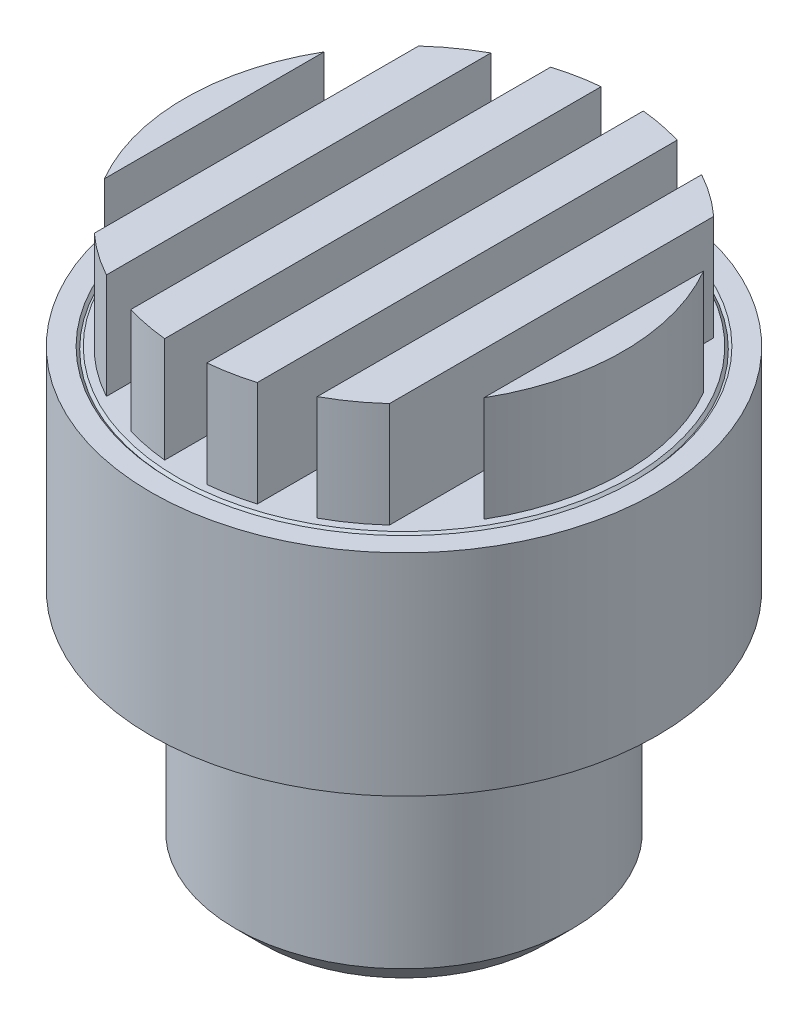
ISO-10303-21;
HEADER;
FILE_DESCRIPTION(('STEP AP214'),'2;1');
FILE_NAME('part.step','',(''),(''),'','','');
FILE_SCHEMA(('AUTOMOTIVE_DESIGN { 1 0 10303 214 1 1 1 1 }'));
ENDSEC;
DATA;
#1=APPLICATION_CONTEXT('core data for automotive mechanical design processes');
#2=APPLICATION_PROTOCOL_DEFINITION('international standard','automotive_design',2000,#1);
#3=PRODUCT_CONTEXT('',#1,'mechanical');
#4=PRODUCT('Part','Part','',(#3));
#5=PRODUCT_RELATED_PRODUCT_CATEGORY('part','',(#4));
#6=PRODUCT_DEFINITION_FORMATION('','',#4);
#7=PRODUCT_DEFINITION_CONTEXT('part definition',#1,'design');
#8=PRODUCT_DEFINITION('design','',#6,#7);
#9=PRODUCT_DEFINITION_SHAPE('','',#8);
#10=(LENGTH_UNIT() NAMED_UNIT(*) SI_UNIT(.MILLI.,.METRE.));
#11=(NAMED_UNIT(*) PLANE_ANGLE_UNIT() SI_UNIT($,.RADIAN.));
#12=(NAMED_UNIT(*) SI_UNIT($,.STERADIAN.) SOLID_ANGLE_UNIT());
#13=UNCERTAINTY_MEASURE_WITH_UNIT(LENGTH_MEASURE(1.E-05),#10,'distance_accuracy_value','');
#14=(GEOMETRIC_REPRESENTATION_CONTEXT(3) GLOBAL_UNCERTAINTY_ASSIGNED_CONTEXT((#13)) GLOBAL_UNIT_ASSIGNED_CONTEXT((#10,
#11,#12)) REPRESENTATION_CONTEXT('',''));
#15=CARTESIAN_POINT('',(0.,0.,0.));
#16=DIRECTION('',(0.,0.,1.));
#17=DIRECTION('',(1.,0.,0.));
#18=AXIS2_PLACEMENT_3D('',#15,#16,#17);
#19=CARTESIAN_POINT('',(7.07690790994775,20.0289948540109,5.52291893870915));
#20=DIRECTION('',(0.,1.,0.));
#21=DIRECTION('',(0.,0.,1.));
#22=AXIS2_PLACEMENT_3D('',#19,#20,#21);
#23=PLANE('',#22);
#24=CARTESIAN_POINT('',(7.07690790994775,20.0289948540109,5.52291893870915));
#25=DIRECTION('',(0.,1.,0.));
#26=DIRECTION('',(0.,0.,1.));
#27=AXIS2_PLACEMENT_3D('',#24,#25,#26);
#28=CIRCLE('',#27,19.05);
#29=CARTESIAN_POINT('',(7.07690790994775,20.0289948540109,24.5729189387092));
#30=VERTEX_POINT('',#29);
#31=EDGE_CURVE('E435',#30,#30,#28,.T.);
#32=ORIENTED_EDGE('',*,*,#31,.T.);
#33=EDGE_LOOP('',(#32));
#34=FACE_BOUND('',#33,.T.);
#35=CARTESIAN_POINT('',(7.07690790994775,20.0289948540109,5.52291893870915));
#36=DIRECTION('',(0.,1.,0.));
#37=DIRECTION('',(0.,0.,1.));
#38=AXIS2_PLACEMENT_3D('',#35,#36,#37);
#39=CIRCLE('',#38,17.4625);
#40=CARTESIAN_POINT('',(7.07690790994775,20.0289948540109,22.9854189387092));
#41=VERTEX_POINT('',#40);
#42=EDGE_CURVE('E276',#41,#41,#39,.F.);
#43=ORIENTED_EDGE('',*,*,#42,.T.);
#44=EDGE_LOOP('',(#43));
#45=FACE_BOUND('',#44,.T.);
#46=ADVANCED_FACE('F17',(#34,#45),#23,.T.);
#47=CARTESIAN_POINT('',(7.07690790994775,4.15399485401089,5.52291893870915));
#48=DIRECTION('',(0.,-1.,0.));
#49=DIRECTION('',(0.,0.,-1.));
#50=AXIS2_PLACEMENT_3D('',#47,#48,#49);
#51=CYLINDRICAL_SURFACE('',#50,12.7);
#52=CARTESIAN_POINT('',(7.07690790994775,-11.5940051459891,5.52291893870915));
#53=DIRECTION('',(0.,1.,0.));
#54=DIRECTION('',(0.,0.,1.));
#55=AXIS2_PLACEMENT_3D('',#52,#53,#54);
#56=CIRCLE('',#55,12.7);
#57=CARTESIAN_POINT('',(7.07690790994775,-11.5940051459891,18.2229189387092));
#58=VERTEX_POINT('',#57);
#59=EDGE_CURVE('E26',#58,#58,#56,.T.);
#60=ORIENTED_EDGE('',*,*,#59,.T.);
#61=EDGE_LOOP('',(#60));
#62=FACE_BOUND('',#61,.T.);
#63=CARTESIAN_POINT('',(7.07690790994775,4.15399485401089,5.52291893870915));
#64=DIRECTION('',(0.,1.,0.));
#65=DIRECTION('',(0.,0.,1.));
#66=AXIS2_PLACEMENT_3D('',#63,#64,#65);
#67=CIRCLE('',#66,12.7);
#68=CARTESIAN_POINT('',(7.07690790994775,4.15399485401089,18.2229189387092));
#69=VERTEX_POINT('',#68);
#70=EDGE_CURVE('E438',#69,#69,#67,.T.);
#71=ORIENTED_EDGE('',*,*,#70,.F.);
#72=EDGE_LOOP('',(#71));
#73=FACE_BOUND('',#72,.T.);
#74=ADVANCED_FACE('F224',(#62,#73),#51,.T.);
#75=CARTESIAN_POINT('',(7.07690790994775,-13.6260051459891,5.52291893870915));
#76=DIRECTION('',(0.,1.,0.));
#77=DIRECTION('',(0.,0.,1.));
#78=AXIS2_PLACEMENT_3D('',#75,#76,#77);
#79=PLANE('',#78);
#80=CARTESIAN_POINT('',(7.07690790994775,-13.6260051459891,5.52291893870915));
#81=DIRECTION('',(0.,-1.,0.));
#82=DIRECTION('',(0.,0.,-1.));
#83=AXIS2_PLACEMENT_3D('',#80,#81,#82);
#84=CIRCLE('',#83,9.398);
#85=CARTESIAN_POINT('',(7.07690790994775,-13.6260051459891,-3.87508106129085));
#86=VERTEX_POINT('',#85);
#87=EDGE_CURVE('E478',#86,#86,#84,.T.);
#88=ORIENTED_EDGE('',*,*,#87,.F.);
#89=EDGE_LOOP('',(#88));
#90=FACE_BOUND('',#89,.T.);
#91=CARTESIAN_POINT('',(7.07690790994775,-13.6260051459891,5.52291893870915));
#92=DIRECTION('',(0.,1.,0.));
#93=DIRECTION('',(0.,0.,1.));
#94=AXIS2_PLACEMENT_3D('',#91,#92,#93);
#95=CIRCLE('',#94,10.668);
#96=CARTESIAN_POINT('',(7.07690790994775,-13.6260051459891,16.1909189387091));
#97=VERTEX_POINT('',#96);
#98=EDGE_CURVE('E11',#97,#97,#95,.F.);
#99=ORIENTED_EDGE('',*,*,#98,.T.);
#100=EDGE_LOOP('',(#99));
#101=FACE_BOUND('',#100,.T.);
#102=ADVANCED_FACE('F231',(#90,#101),#79,.F.);
#103=CARTESIAN_POINT('',(7.07690790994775,20.0289948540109,5.52291893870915));
#104=DIRECTION('',(0.,-1.,0.));
#105=DIRECTION('',(0.,0.,-1.));
#106=AXIS2_PLACEMENT_3D('',#103,#104,#105);
#107=CYLINDRICAL_SURFACE('',#106,19.05);
#108=ORIENTED_EDGE('',*,*,#31,.F.);
#109=EDGE_LOOP('',(#108));
#110=FACE_BOUND('',#109,.T.);
#111=CARTESIAN_POINT('',(7.07690790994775,4.15399485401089,5.52291893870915));
#112=DIRECTION('',(0.,1.,0.));
#113=DIRECTION('',(0.,0.,1.));
#114=AXIS2_PLACEMENT_3D('',#111,#112,#113);
#115=CIRCLE('',#114,19.05);
#116=CARTESIAN_POINT('',(7.07690790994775,4.15399485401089,24.5729189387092));
#117=VERTEX_POINT('',#116);
#118=EDGE_CURVE('E439',#117,#117,#115,.T.);
#119=ORIENTED_EDGE('',*,*,#118,.T.);
#120=EDGE_LOOP('',(#119));
#121=FACE_BOUND('',#120,.T.);
#122=ADVANCED_FACE('F464',(#110,#121),#107,.T.);
#123=CARTESIAN_POINT('',(7.07690790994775,4.15399485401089,5.52291893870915));
#124=DIRECTION('',(0.,1.,0.));
#125=DIRECTION('',(0.,0.,1.));
#126=AXIS2_PLACEMENT_3D('',#123,#124,#125);
#127=PLANE('',#126);
#128=ORIENTED_EDGE('',*,*,#70,.T.);
#129=EDGE_LOOP('',(#128));
#130=FACE_BOUND('',#129,.T.);
#131=ORIENTED_EDGE('',*,*,#118,.F.);
#132=EDGE_LOOP('',(#131));
#133=FACE_BOUND('',#132,.T.);
#134=ADVANCED_FACE('F455',(#130,#133),#127,.F.);
#135=CARTESIAN_POINT('',(7.07690790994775,-11.5940051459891,5.52291893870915));
#136=DIRECTION('',(0.,1.,0.));
#137=DIRECTION('',(0.,0.,1.));
#138=AXIS2_PLACEMENT_3D('',#135,#136,#137);
#139=CONICAL_SURFACE('',#138,12.7,0.78539816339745);
#140=ORIENTED_EDGE('',*,*,#98,.F.);
#141=EDGE_LOOP('',(#140));
#142=FACE_BOUND('',#141,.T.);
#143=ORIENTED_EDGE('',*,*,#59,.F.);
#144=EDGE_LOOP('',(#143));
#145=FACE_BOUND('',#144,.T.);
#146=ADVANCED_FACE('F19',(#142,#145),#139,.T.);
#147=CARTESIAN_POINT('',(7.07690790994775,19.6479948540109,5.52291893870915));
#148=DIRECTION('',(0.,1.,0.));
#149=DIRECTION('',(0.,0.,1.));
#150=AXIS2_PLACEMENT_3D('',#147,#148,#149);
#151=CONICAL_SURFACE('',#150,17.0815,0.785398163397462);
#152=CARTESIAN_POINT('',(7.07690790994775,19.8384948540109,5.52291893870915));
#153=DIRECTION('',(0.,-1.,0.));
#154=DIRECTION('',(0.,0.,-1.));
#155=AXIS2_PLACEMENT_3D('',#152,#153,#154);
#156=CIRCLE('',#155,17.272);
#157=CARTESIAN_POINT('',(-10.1950920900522,19.8384948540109,5.52291893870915));
#158=VERTEX_POINT('',#157);
#159=EDGE_CURVE('E270',#158,#158,#156,.F.);
#160=ORIENTED_EDGE('',*,*,#159,.F.);
#161=EDGE_LOOP('',(#160));
#162=FACE_BOUND('',#161,.T.);
#163=ORIENTED_EDGE('',*,*,#42,.F.);
#164=EDGE_LOOP('',(#163));
#165=FACE_BOUND('',#164,.T.);
#166=ADVANCED_FACE('F454',(#162,#165),#151,.F.);
#167=CARTESIAN_POINT('',(7.07690790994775,20.0289948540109,5.52291893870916));
#168=DIRECTION('',(0.,-1.,0.));
#169=DIRECTION('',(-1.,0.,0.));
#170=AXIS2_PLACEMENT_3D('',#167,#168,#169);
#171=CONICAL_SURFACE('',#170,17.0815,0.785398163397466);
#172=CARTESIAN_POINT('',(7.07690790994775,20.0289948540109,5.52291893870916));
#173=DIRECTION('',(0.,1.,0.));
#174=DIRECTION('',(1.,0.,0.));
#175=AXIS2_PLACEMENT_3D('',#172,#173,#174);
#176=CIRCLE('',#175,17.0815);
#177=CARTESIAN_POINT('',(-10.0045920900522,20.0289948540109,5.52291893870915));
#178=VERTEX_POINT('',#177);
#179=EDGE_CURVE('E267',#178,#178,#176,.T.);
#180=CARTESIAN_POINT('',(-10.0045920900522,20.0289948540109,5.52291893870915));
#181=CARTESIAN_POINT('',(-10.0065764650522,20.0270104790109,5.52291893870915));
#182=CARTESIAN_POINT('',(-10.0085608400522,20.0250261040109,5.52291893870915));
#183=CARTESIAN_POINT('',(-10.0125295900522,20.0210573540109,5.52291893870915));
#184=CARTESIAN_POINT('',(-10.0145139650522,20.0190729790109,5.52291893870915));
#185=CARTESIAN_POINT('',(-10.0184827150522,20.0151042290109,5.52291893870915));
#186=CARTESIAN_POINT('',(-10.0204670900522,20.0131198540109,5.52291893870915));
#187=CARTESIAN_POINT('',(-10.0244358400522,20.0091511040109,5.52291893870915));
#188=CARTESIAN_POINT('',(-10.0264202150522,20.0071667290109,5.52291893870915));
#189=CARTESIAN_POINT('',(-10.0303889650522,20.0031979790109,5.52291893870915));
#190=CARTESIAN_POINT('',(-10.0323733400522,20.0012136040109,5.52291893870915));
#191=CARTESIAN_POINT('',(-10.0363420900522,19.9972448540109,5.52291893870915));
#192=CARTESIAN_POINT('',(-10.0383264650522,19.9952604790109,5.52291893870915));
#193=CARTESIAN_POINT('',(-10.0422952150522,19.9912917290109,5.52291893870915));
#194=CARTESIAN_POINT('',(-10.0442795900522,19.9893073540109,5.52291893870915));
#195=CARTESIAN_POINT('',(-10.0482483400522,19.9853386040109,5.52291893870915));
#196=CARTESIAN_POINT('',(-10.0502327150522,19.9833542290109,5.52291893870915));
#197=CARTESIAN_POINT('',(-10.0542014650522,19.9793854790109,5.52291893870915));
#198=CARTESIAN_POINT('',(-10.0561858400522,19.9774011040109,5.52291893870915));
#199=CARTESIAN_POINT('',(-10.0601545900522,19.9734323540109,5.52291893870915));
#200=CARTESIAN_POINT('',(-10.0621389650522,19.9714479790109,5.52291893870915));
#201=CARTESIAN_POINT('',(-10.0661077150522,19.9674792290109,5.52291893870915));
#202=CARTESIAN_POINT('',(-10.0680920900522,19.9654948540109,5.52291893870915));
#203=CARTESIAN_POINT('',(-10.0720608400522,19.9615261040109,5.52291893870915));
#204=CARTESIAN_POINT('',(-10.0740452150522,19.9595417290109,5.52291893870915));
#205=CARTESIAN_POINT('',(-10.0780139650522,19.9555729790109,5.52291893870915));
#206=CARTESIAN_POINT('',(-10.0799983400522,19.9535886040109,5.52291893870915));
#207=CARTESIAN_POINT('',(-10.0839670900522,19.9496198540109,5.52291893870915));
#208=CARTESIAN_POINT('',(-10.0859514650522,19.9476354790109,5.52291893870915));
#209=CARTESIAN_POINT('',(-10.0899202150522,19.9436667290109,5.52291893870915));
#210=CARTESIAN_POINT('',(-10.0919045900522,19.9416823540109,5.52291893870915));
#211=CARTESIAN_POINT('',(-10.0958733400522,19.9377136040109,5.52291893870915));
#212=CARTESIAN_POINT('',(-10.0978577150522,19.9357292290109,5.52291893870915));
#213=CARTESIAN_POINT('',(-10.1018264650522,19.9317604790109,5.52291893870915));
#214=CARTESIAN_POINT('',(-10.1038108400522,19.9297761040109,5.52291893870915));
#215=CARTESIAN_POINT('',(-10.1077795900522,19.9258073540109,5.52291893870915));
#216=CARTESIAN_POINT('',(-10.1097639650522,19.9238229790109,5.52291893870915));
#217=CARTESIAN_POINT('',(-10.1137327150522,19.9198542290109,5.52291893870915));
#218=CARTESIAN_POINT('',(-10.1157170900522,19.9178698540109,5.52291893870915));
#219=CARTESIAN_POINT('',(-10.1196858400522,19.9139011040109,5.52291893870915));
#220=CARTESIAN_POINT('',(-10.1216702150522,19.9119167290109,5.52291893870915));
#221=CARTESIAN_POINT('',(-10.1256389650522,19.9079479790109,5.52291893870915));
#222=CARTESIAN_POINT('',(-10.1276233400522,19.9059636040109,5.52291893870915));
#223=CARTESIAN_POINT('',(-10.1315920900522,19.9019948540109,5.52291893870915));
#224=CARTESIAN_POINT('',(-10.1335764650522,19.9000104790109,5.52291893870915));
#225=CARTESIAN_POINT('',(-10.1375452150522,19.8960417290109,5.52291893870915));
#226=CARTESIAN_POINT('',(-10.1395295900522,19.8940573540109,5.52291893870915));
#227=CARTESIAN_POINT('',(-10.1434983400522,19.8900886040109,5.52291893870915));
#228=CARTESIAN_POINT('',(-10.1454827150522,19.8881042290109,5.52291893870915));
#229=CARTESIAN_POINT('',(-10.1494514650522,19.8841354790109,5.52291893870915));
#230=CARTESIAN_POINT('',(-10.1514358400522,19.8821511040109,5.52291893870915));
#231=CARTESIAN_POINT('',(-10.1554045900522,19.8781823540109,5.52291893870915));
#232=CARTESIAN_POINT('',(-10.1573889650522,19.8761979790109,5.52291893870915));
#233=CARTESIAN_POINT('',(-10.1613577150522,19.8722292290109,5.52291893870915));
#234=CARTESIAN_POINT('',(-10.1633420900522,19.8702448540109,5.52291893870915));
#235=CARTESIAN_POINT('',(-10.1673108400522,19.8662761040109,5.52291893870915));
#236=CARTESIAN_POINT('',(-10.1692952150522,19.8642917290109,5.52291893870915));
#237=CARTESIAN_POINT('',(-10.1732639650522,19.8603229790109,5.52291893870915));
#238=CARTESIAN_POINT('',(-10.1752483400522,19.8583386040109,5.52291893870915));
#239=CARTESIAN_POINT('',(-10.1792170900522,19.8543698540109,5.52291893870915));
#240=CARTESIAN_POINT('',(-10.1812014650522,19.8523854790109,5.52291893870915));
#241=CARTESIAN_POINT('',(-10.1851702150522,19.8484167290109,5.52291893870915));
#242=CARTESIAN_POINT('',(-10.1871545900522,19.8464323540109,5.52291893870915));
#243=CARTESIAN_POINT('',(-10.1911233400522,19.8424636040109,5.52291893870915));
#244=CARTESIAN_POINT('',(-10.1931077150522,19.8404792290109,5.52291893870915));
#245=CARTESIAN_POINT('',(-10.1950920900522,19.8384948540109,5.52291893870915));
#246=B_SPLINE_CURVE_WITH_KNOTS('',3,(#180,#181,#182,#183,#184,#185,#186,#187,#188,#189,#190,
#191,#192,#193,#194,#195,#196,#197,#198,#199,#200,#201,#202,#203,#204,#205,#206,#207,#208,#209,
#210,#211,#212,#213,#214,#215,#216,#217,#218,#219,#220,#221,#222,#223,#224,#225,#226,#227,#228,
#229,#230,#231,#232,#233,#234,#235,#236,#237,#238,#239,#240,#241,#242,#243,#244,#245),
.UNSPECIFIED.,.F.,.F.,(4,2,2,2,2,2,2,2,2,2,2,2,2,2,2,2,2,2,2,2,2,2,2,2,2,2,2,2,2,2,2,2,4),(0.,
0.00841899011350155,0.0168379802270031,0.0252569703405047,0.0336759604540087,0.0420949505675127,
0.0505139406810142,0.0589329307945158,0.0673519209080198,0.0757709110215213,0.0841899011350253,
0.0926088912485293,0.101027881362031,0.109446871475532,0.117865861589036,0.12628485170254,
0.134703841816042,0.143122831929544,0.151541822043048,0.159960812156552,0.168379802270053,
0.176798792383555,0.185217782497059,0.193636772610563,0.202055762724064,0.210474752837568,
0.21889374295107,0.227312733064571,0.235731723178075,0.244150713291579,0.252569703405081,
0.260988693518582,0.269407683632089),.UNSPECIFIED.);
#247=EDGE_CURVE('BSEAM461',#178,#158,#246,.T.);
#248=ORIENTED_EDGE('',*,*,#179,.F.);
#249=ORIENTED_EDGE('',*,*,#159,.T.);
#250=ORIENTED_EDGE('',*,*,#247,.T.);
#251=ORIENTED_EDGE('',*,*,#247,.F.);
#252=EDGE_LOOP('',(#248,#250,#249,#251));
#253=FACE_BOUND('',#252,.T.);
#254=ADVANCED_FACE('F461',(#253),#171,.T.);
#255=CARTESIAN_POINT('',(7.07690790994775,7.32899485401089,5.52291893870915));
#256=DIRECTION('',(0.,1.,0.));
#257=DIRECTION('',(0.,0.,1.));
#258=AXIS2_PLACEMENT_3D('',#255,#256,#257);
#259=PLANE('',#258);
#260=CARTESIAN_POINT('',(7.07690790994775,7.32899485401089,5.52291893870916));
#261=DIRECTION('',(0.,1.,0.));
#262=DIRECTION('',(1.,0.,0.));
#263=AXIS2_PLACEMENT_3D('',#260,#261,#262);
#264=CIRCLE('',#263,10.668);
#265=CARTESIAN_POINT('',(17.7449079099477,7.32899485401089,5.52291893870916));
#266=VERTEX_POINT('',#265);
#267=EDGE_CURVE('E284',#266,#266,#264,.F.);
#268=ORIENTED_EDGE('',*,*,#267,.F.);
#269=EDGE_LOOP('',(#268));
#270=FACE_BOUND('',#269,.T.);
#271=CARTESIAN_POINT('',(7.07690790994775,7.32899485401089,5.52291893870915));
#272=DIRECTION('',(0.,1.,0.));
#273=DIRECTION('',(0.,0.,1.));
#274=AXIS2_PLACEMENT_3D('',#271,#272,#273);
#275=CIRCLE('',#274,11.2313249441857);
#276=CARTESIAN_POINT('',(7.07690790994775,7.32899485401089,16.7542438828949));
#277=VERTEX_POINT('',#276);
#278=EDGE_CURVE('E280',#277,#277,#275,.F.);
#279=ORIENTED_EDGE('',*,*,#278,.T.);
#280=EDGE_LOOP('',(#279));
#281=FACE_BOUND('',#280,.T.);
#282=ADVANCED_FACE('F219',(#270,#281),#259,.F.);
#283=CARTESIAN_POINT('',(7.07690790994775,-13.6260051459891,5.52291893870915));
#284=DIRECTION('',(0.,1.,0.));
#285=DIRECTION('',(0.,0.,-1.));
#286=AXIS2_PLACEMENT_3D('',#283,#284,#285);
#287=CONICAL_SURFACE('',#286,9.398,0.0872664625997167);
#288=ORIENTED_EDGE('',*,*,#87,.T.);
#289=EDGE_LOOP('',(#288));
#290=FACE_BOUND('',#289,.T.);
#291=ORIENTED_EDGE('',*,*,#278,.F.);
#292=EDGE_LOOP('',(#291));
#293=FACE_BOUND('',#292,.T.);
#294=ADVANCED_FACE('F207',(#290,#293),#287,.F.);
#295=CARTESIAN_POINT('',(7.07690790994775,-13.6081340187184,5.52291893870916));
#296=DIRECTION('',(0.,1.,0.));
#297=DIRECTION('',(0.,0.,1.));
#298=AXIS2_PLACEMENT_3D('',#295,#296,#297);
#299=CONICAL_SURFACE('',#298,0.,0.471238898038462);
#300=ORIENTED_EDGE('',*,*,#267,.T.);
#301=EDGE_LOOP('',(#300));
#302=FACE_BOUND('',#301,.T.);
#303=CARTESIAN_POINT('',(7.07690790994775,-13.6081340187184,5.52291893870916));
#304=VERTEX_POINT('',#303);
#305=VERTEX_LOOP('',#304);
#306=FACE_BOUND('',#305,.T.);
#307=ADVANCED_FACE('F204',(#302,#306),#299,.T.);
#308=CARTESIAN_POINT('',(7.07690790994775,27.9537948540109,5.52291893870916));
#309=DIRECTION('',(0.,1.,0.));
#310=DIRECTION('',(1.,0.,0.));
#311=AXIS2_PLACEMENT_3D('',#308,#309,#310);
#312=PLANE('',#311);
#313=CARTESIAN_POINT('',(7.07690790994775,27.9537948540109,5.52291893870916));
#314=DIRECTION('',(0.,1.,0.));
#315=DIRECTION('',(1.,0.,0.));
#316=AXIS2_PLACEMENT_3D('',#313,#314,#315);
#317=CIRCLE('',#316,16.51);
#318=CARTESIAN_POINT('',(-0.860592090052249,27.9537948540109,-8.9538277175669));
#319=VERTEX_POINT('',#318);
#320=CARTESIAN_POINT('',(-4.03559209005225,27.9537948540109,-6.68742273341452));
#321=VERTEX_POINT('',#320);
#322=EDGE_CURVE('E591',#319,#321,#317,.T.);
#323=ORIENTED_EDGE('',*,*,#322,.T.);
#324=DIRECTION('',(0.,0.,1.));
#325=VECTOR('',#324,1.);
#326=CARTESIAN_POINT('',(-4.03559209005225,27.9537948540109,-6.68742273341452));
#327=LINE('',#326,#325);
#328=CARTESIAN_POINT('',(-4.03559209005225,27.9537948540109,17.7332606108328));
#329=VERTEX_POINT('',#328);
#330=EDGE_CURVE('E387',#321,#329,#327,.T.);
#331=ORIENTED_EDGE('',*,*,#330,.T.);
#332=CARTESIAN_POINT('',(-0.860592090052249,27.9537948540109,19.9996655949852));
#333=VERTEX_POINT('',#332);
#334=EDGE_CURVE('E600',#329,#333,#317,.T.);
#335=ORIENTED_EDGE('',*,*,#334,.T.);
#336=DIRECTION('',(0.,0.,-1.));
#337=VECTOR('',#336,1.);
#338=CARTESIAN_POINT('',(-0.860592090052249,27.9537948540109,-8.9538277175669));
#339=LINE('',#338,#337);
#340=EDGE_CURVE('E373',#333,#319,#339,.T.);
#341=ORIENTED_EDGE('',*,*,#340,.T.);
#342=EDGE_LOOP('',(#323,#331,#335,#341));
#343=FACE_BOUND('',#342,.T.);
#344=ADVANCED_FACE('F206',(#343),#312,.T.);
#345=CARTESIAN_POINT('',(-7.21059209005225,27.9537948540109,-2.75037809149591));
#346=VERTEX_POINT('',#345);
#347=CARTESIAN_POINT('',(-7.21059209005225,27.9537948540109,13.7962159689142));
#348=VERTEX_POINT('',#347);
#349=EDGE_CURVE('E596',#346,#348,#317,.T.);
#350=ORIENTED_EDGE('',*,*,#349,.T.);
#351=DIRECTION('',(0.,0.,-1.));
#352=VECTOR('',#351,1.);
#353=CARTESIAN_POINT('',(-7.21059209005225,27.9537948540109,-2.75037809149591));
#354=LINE('',#353,#352);
#355=EDGE_CURVE('E401',#348,#346,#354,.T.);
#356=ORIENTED_EDGE('',*,*,#355,.T.);
#357=EDGE_LOOP('',(#350,#356));
#358=FACE_BOUND('',#357,.T.);
#359=ADVANCED_FACE('F215',(#358),#312,.T.);
#360=CARTESIAN_POINT('',(5.48940790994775,27.9537948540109,-10.9105817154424));
#361=VERTEX_POINT('',#360);
#362=CARTESIAN_POINT('',(2.31440790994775,27.9537948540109,-10.2852654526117));
#363=VERTEX_POINT('',#362);
#364=EDGE_CURVE('E586',#361,#363,#317,.T.);
#365=ORIENTED_EDGE('',*,*,#364,.T.);
#366=DIRECTION('',(0.,0.,1.));
#367=VECTOR('',#366,1.);
#368=CARTESIAN_POINT('',(2.31440790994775,27.9537948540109,-10.2852654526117));
#369=LINE('',#368,#367);
#370=CARTESIAN_POINT('',(2.31440790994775,27.9537948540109,21.33110333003));
#371=VERTEX_POINT('',#370);
#372=EDGE_CURVE('E359',#363,#371,#369,.T.);
#373=ORIENTED_EDGE('',*,*,#372,.T.);
#374=CARTESIAN_POINT('',(5.48940790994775,27.9537948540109,21.9564195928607));
#375=VERTEX_POINT('',#374);
#376=EDGE_CURVE('E605',#371,#375,#317,.T.);
#377=ORIENTED_EDGE('',*,*,#376,.T.);
#378=DIRECTION('',(0.,0.,-1.));
#379=VECTOR('',#378,1.);
#380=CARTESIAN_POINT('',(5.48940790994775,27.9537948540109,-10.9105817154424));
#381=LINE('',#380,#379);
#382=EDGE_CURVE('E345',#375,#361,#381,.T.);
#383=ORIENTED_EDGE('',*,*,#382,.T.);
#384=EDGE_LOOP('',(#365,#373,#377,#383));
#385=FACE_BOUND('',#384,.T.);
#386=ADVANCED_FACE('F218',(#385),#312,.T.);
#387=CARTESIAN_POINT('',(11.8394079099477,27.9537948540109,-10.2852654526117));
#388=VERTEX_POINT('',#387);
#389=CARTESIAN_POINT('',(8.66440790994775,27.9537948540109,-10.9105817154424));
#390=VERTEX_POINT('',#389);
#391=EDGE_CURVE('E581',#388,#390,#317,.T.);
#392=ORIENTED_EDGE('',*,*,#391,.T.);
#393=DIRECTION('',(0.,0.,1.));
#394=VECTOR('',#393,1.);
#395=CARTESIAN_POINT('',(8.66440790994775,27.9537948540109,-10.9105817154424));
#396=LINE('',#395,#394);
#397=CARTESIAN_POINT('',(8.66440790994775,27.9537948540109,21.9564195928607));
#398=VERTEX_POINT('',#397);
#399=EDGE_CURVE('E331',#390,#398,#396,.T.);
#400=ORIENTED_EDGE('',*,*,#399,.T.);
#401=CARTESIAN_POINT('',(11.8394079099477,27.9537948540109,21.33110333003));
#402=VERTEX_POINT('',#401);
#403=EDGE_CURVE('E610',#398,#402,#317,.T.);
#404=ORIENTED_EDGE('',*,*,#403,.T.);
#405=DIRECTION('',(0.,0.,-1.));
#406=VECTOR('',#405,1.);
#407=CARTESIAN_POINT('',(11.8394079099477,27.9537948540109,-10.2852654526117));
#408=LINE('',#407,#406);
#409=EDGE_CURVE('E317',#402,#388,#408,.T.);
#410=ORIENTED_EDGE('',*,*,#409,.T.);
#411=EDGE_LOOP('',(#392,#400,#404,#410));
#412=FACE_BOUND('',#411,.T.);
#413=ADVANCED_FACE('F556',(#412),#312,.T.);
#414=CARTESIAN_POINT('',(18.1894079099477,27.9537948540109,-6.68742273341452));
#415=VERTEX_POINT('',#414);
#416=CARTESIAN_POINT('',(15.0144079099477,27.9537948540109,-8.9538277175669));
#417=VERTEX_POINT('',#416);
#418=EDGE_CURVE('E429',#415,#417,#317,.T.);
#419=ORIENTED_EDGE('',*,*,#418,.T.);
#420=DIRECTION('',(0.,0.,1.));
#421=VECTOR('',#420,1.);
#422=CARTESIAN_POINT('',(15.0144079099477,27.9537948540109,-8.9538277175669));
#423=LINE('',#422,#421);
#424=CARTESIAN_POINT('',(15.0144079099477,27.9537948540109,19.9996655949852));
#425=VERTEX_POINT('',#424);
#426=EDGE_CURVE('E303',#417,#425,#423,.T.);
#427=ORIENTED_EDGE('',*,*,#426,.T.);
#428=CARTESIAN_POINT('',(18.1894079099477,27.9537948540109,17.7332606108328));
#429=VERTEX_POINT('',#428);
#430=EDGE_CURVE('E434',#425,#429,#317,.T.);
#431=ORIENTED_EDGE('',*,*,#430,.T.);
#432=DIRECTION('',(0.,0.,-1.));
#433=VECTOR('',#432,1.);
#434=CARTESIAN_POINT('',(18.1894079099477,27.9537948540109,-6.68742273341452));
#435=LINE('',#434,#433);
#436=EDGE_CURVE('E296',#429,#415,#435,.T.);
#437=ORIENTED_EDGE('',*,*,#436,.T.);
#438=EDGE_LOOP('',(#419,#427,#431,#437));
#439=FACE_BOUND('',#438,.T.);
#440=ADVANCED_FACE('F560',(#439),#312,.T.);
#441=CARTESIAN_POINT('',(21.3644079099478,27.9537948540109,13.7962159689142));
#442=VERTEX_POINT('',#441);
#443=CARTESIAN_POINT('',(21.3644079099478,27.9537948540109,-2.75037809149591));
#444=VERTEX_POINT('',#443);
#445=EDGE_CURVE('E422',#442,#444,#317,.T.);
#446=ORIENTED_EDGE('',*,*,#445,.T.);
#447=DIRECTION('',(0.,0.,1.));
#448=VECTOR('',#447,1.);
#449=CARTESIAN_POINT('',(21.3644079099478,27.9537948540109,-2.75037809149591));
#450=LINE('',#449,#448);
#451=EDGE_CURVE('E289',#444,#442,#450,.T.);
#452=ORIENTED_EDGE('',*,*,#451,.T.);
#453=EDGE_LOOP('',(#446,#452));
#454=FACE_BOUND('',#453,.T.);
#455=ADVANCED_FACE('F552',(#454),#312,.T.);
#456=CARTESIAN_POINT('',(7.07690790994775,20.0289948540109,5.52291893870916));
#457=DIRECTION('',(0.,1.,0.));
#458=DIRECTION('',(1.,0.,0.));
#459=AXIS2_PLACEMENT_3D('',#456,#457,#458);
#460=CYLINDRICAL_SURFACE('',#459,16.51);
#461=CARTESIAN_POINT('',(7.07690790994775,20.0289948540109,5.52291893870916));
#462=DIRECTION('',(0.,1.,0.));
#463=DIRECTION('',(1.,0.,0.));
#464=AXIS2_PLACEMENT_3D('',#461,#462,#463);
#465=CIRCLE('',#464,16.51);
#466=CARTESIAN_POINT('',(-0.860592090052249,20.0289948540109,-8.9538277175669));
#467=VERTEX_POINT('',#466);
#468=CARTESIAN_POINT('',(-4.03559209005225,20.0289948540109,-6.68742273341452));
#469=VERTEX_POINT('',#468);
#470=EDGE_CURVE('E635',#467,#469,#465,.T.);
#471=ORIENTED_EDGE('',*,*,#470,.T.);
#472=DIRECTION('',(0.,1.,0.));
#473=VECTOR('',#472,1.);
#474=CARTESIAN_POINT('',(-4.03559209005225,20.0289948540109,-6.68742273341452));
#475=LINE('',#474,#473);
#476=EDGE_CURVE('E402',#469,#321,#475,.T.);
#477=ORIENTED_EDGE('',*,*,#476,.T.);
#478=ORIENTED_EDGE('',*,*,#322,.F.);
#479=DIRECTION('',(0.,1.,0.));
#480=VECTOR('',#479,1.);
#481=CARTESIAN_POINT('',(-0.860592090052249,20.0289948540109,-8.9538277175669));
#482=LINE('',#481,#480);
#483=EDGE_CURVE('E406',#467,#319,#482,.T.);
#484=ORIENTED_EDGE('',*,*,#483,.F.);
#485=EDGE_LOOP('',(#471,#477,#478,#484));
#486=FACE_BOUND('',#485,.T.);
#487=ADVANCED_FACE('F539',(#486),#460,.T.);
#488=CARTESIAN_POINT('',(-4.03559209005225,20.0289948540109,-6.68742273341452));
#489=DIRECTION('',(-1.,0.,0.));
#490=DIRECTION('',(0.,1.,0.));
#491=AXIS2_PLACEMENT_3D('',#488,#489,#490);
#492=PLANE('',#491);
#493=ORIENTED_EDGE('',*,*,#330,.F.);
#494=ORIENTED_EDGE('',*,*,#476,.F.);
#495=DIRECTION('',(0.,0.,1.));
#496=VECTOR('',#495,1.);
#497=CARTESIAN_POINT('',(-4.03559209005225,20.0289948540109,-6.68742273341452));
#498=LINE('',#497,#496);
#499=CARTESIAN_POINT('',(-4.03559209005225,20.0289948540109,17.7332606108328));
#500=VERTEX_POINT('',#499);
#501=EDGE_CURVE('E386',#469,#500,#498,.T.);
#502=ORIENTED_EDGE('',*,*,#501,.T.);
#503=DIRECTION('',(0.,1.,0.));
#504=VECTOR('',#503,1.);
#505=CARTESIAN_POINT('',(-4.03559209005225,20.0289948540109,17.7332606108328));
#506=LINE('',#505,#504);
#507=EDGE_CURVE('E398',#500,#329,#506,.T.);
#508=ORIENTED_EDGE('',*,*,#507,.T.);
#509=EDGE_LOOP('',(#493,#494,#502,#508));
#510=FACE_BOUND('',#509,.T.);
#511=ADVANCED_FACE('F535',(#510),#492,.T.);
#512=ORIENTED_EDGE('',*,*,#334,.F.);
#513=ORIENTED_EDGE('',*,*,#507,.F.);
#514=CARTESIAN_POINT('',(-0.860592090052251,20.0289948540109,19.9996655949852));
#515=VERTEX_POINT('',#514);
#516=EDGE_CURVE('E644',#500,#515,#465,.T.);
#517=ORIENTED_EDGE('',*,*,#516,.T.);
#518=DIRECTION('',(0.,1.,0.));
#519=VECTOR('',#518,1.);
#520=CARTESIAN_POINT('',(-0.860592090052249,20.0289948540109,19.9996655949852));
#521=LINE('',#520,#519);
#522=EDGE_CURVE('E391',#515,#333,#521,.T.);
#523=ORIENTED_EDGE('',*,*,#522,.T.);
#524=EDGE_LOOP('',(#512,#513,#517,#523));
#525=FACE_BOUND('',#524,.T.);
#526=ADVANCED_FACE('F538',(#525),#460,.T.);
#527=CARTESIAN_POINT('',(-0.860592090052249,20.0289948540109,-8.9538277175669));
#528=DIRECTION('',(1.,0.,0.));
#529=DIRECTION('',(0.,-1.,0.));
#530=AXIS2_PLACEMENT_3D('',#527,#528,#529);
#531=PLANE('',#530);
#532=ORIENTED_EDGE('',*,*,#340,.F.);
#533=ORIENTED_EDGE('',*,*,#522,.F.);
#534=DIRECTION('',(0.,0.,-1.));
#535=VECTOR('',#534,1.);
#536=CARTESIAN_POINT('',(-0.860592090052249,20.0289948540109,-8.9538277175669));
#537=LINE('',#536,#535);
#538=EDGE_CURVE('E263',#515,#467,#537,.T.);
#539=ORIENTED_EDGE('',*,*,#538,.T.);
#540=ORIENTED_EDGE('',*,*,#483,.T.);
#541=EDGE_LOOP('',(#532,#533,#539,#540));
#542=FACE_BOUND('',#541,.T.);
#543=ADVANCED_FACE('F541',(#542),#531,.T.);
#544=CARTESIAN_POINT('',(-7.21059209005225,20.0289948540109,-2.75037809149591));
#545=DIRECTION('',(1.,0.,0.));
#546=DIRECTION('',(0.,-1.,0.));
#547=AXIS2_PLACEMENT_3D('',#544,#545,#546);
#548=PLANE('',#547);
#549=ORIENTED_EDGE('',*,*,#355,.F.);
#550=DIRECTION('',(0.,1.,0.));
#551=VECTOR('',#550,1.);
#552=CARTESIAN_POINT('',(-7.21059209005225,20.0289948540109,13.7962159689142));
#553=LINE('',#552,#551);
#554=CARTESIAN_POINT('',(-7.21059209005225,20.0289948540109,13.7962159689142));
#555=VERTEX_POINT('',#554);
#556=EDGE_CURVE('E415',#555,#348,#553,.T.);
#557=ORIENTED_EDGE('',*,*,#556,.F.);
#558=DIRECTION('',(0.,0.,-1.));
#559=VECTOR('',#558,1.);
#560=CARTESIAN_POINT('',(-7.21059209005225,20.0289948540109,-2.75037809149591));
#561=LINE('',#560,#559);
#562=CARTESIAN_POINT('',(-7.21059209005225,20.0289948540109,-2.75037809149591));
#563=VERTEX_POINT('',#562);
#564=EDGE_CURVE('E412',#555,#563,#561,.T.);
#565=ORIENTED_EDGE('',*,*,#564,.T.);
#566=DIRECTION('',(0.,1.,0.));
#567=VECTOR('',#566,1.);
#568=CARTESIAN_POINT('',(-7.21059209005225,20.0289948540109,-2.75037809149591));
#569=LINE('',#568,#567);
#570=EDGE_CURVE('E419',#563,#346,#569,.T.);
#571=ORIENTED_EDGE('',*,*,#570,.T.);
#572=EDGE_LOOP('',(#549,#557,#565,#571));
#573=FACE_BOUND('',#572,.T.);
#574=ADVANCED_FACE('F544',(#573),#548,.T.);
#575=ORIENTED_EDGE('',*,*,#349,.F.);
#576=ORIENTED_EDGE('',*,*,#570,.F.);
#577=EDGE_CURVE('E259',#563,#555,#465,.T.);
#578=ORIENTED_EDGE('',*,*,#577,.T.);
#579=ORIENTED_EDGE('',*,*,#556,.T.);
#580=EDGE_LOOP('',(#575,#576,#578,#579));
#581=FACE_BOUND('',#580,.T.);
#582=ADVANCED_FACE('F244',(#581),#460,.T.);
#583=CARTESIAN_POINT('',(5.48940790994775,20.0289948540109,-10.9105817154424));
#584=VERTEX_POINT('',#583);
#585=CARTESIAN_POINT('',(2.31440790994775,20.0289948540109,-10.2852654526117));
#586=VERTEX_POINT('',#585);
#587=EDGE_CURVE('E629',#584,#586,#465,.T.);
#588=ORIENTED_EDGE('',*,*,#587,.T.);
#589=DIRECTION('',(0.,1.,0.));
#590=VECTOR('',#589,1.);
#591=CARTESIAN_POINT('',(2.31440790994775,20.0289948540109,-10.2852654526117));
#592=LINE('',#591,#590);
#593=EDGE_CURVE('E374',#586,#363,#592,.T.);
#594=ORIENTED_EDGE('',*,*,#593,.T.);
#595=ORIENTED_EDGE('',*,*,#364,.F.);
#596=DIRECTION('',(0.,1.,0.));
#597=VECTOR('',#596,1.);
#598=CARTESIAN_POINT('',(5.48940790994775,20.0289948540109,-10.9105817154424));
#599=LINE('',#598,#597);
#600=EDGE_CURVE('E378',#584,#361,#599,.T.);
#601=ORIENTED_EDGE('',*,*,#600,.F.);
#602=EDGE_LOOP('',(#588,#594,#595,#601));
#603=FACE_BOUND('',#602,.T.);
#604=ADVANCED_FACE('F529',(#603),#460,.T.);
#605=CARTESIAN_POINT('',(2.31440790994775,20.0289948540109,-10.2852654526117));
#606=DIRECTION('',(-1.,0.,0.));
#607=DIRECTION('',(0.,1.,0.));
#608=AXIS2_PLACEMENT_3D('',#605,#606,#607);
#609=PLANE('',#608);
#610=ORIENTED_EDGE('',*,*,#372,.F.);
#611=ORIENTED_EDGE('',*,*,#593,.F.);
#612=DIRECTION('',(0.,0.,1.));
#613=VECTOR('',#612,1.);
#614=CARTESIAN_POINT('',(2.31440790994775,20.0289948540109,-10.2852654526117));
#615=LINE('',#614,#613);
#616=CARTESIAN_POINT('',(2.31440790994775,20.0289948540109,21.33110333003));
#617=VERTEX_POINT('',#616);
#618=EDGE_CURVE('E358',#586,#617,#615,.T.);
#619=ORIENTED_EDGE('',*,*,#618,.T.);
#620=DIRECTION('',(0.,1.,0.));
#621=VECTOR('',#620,1.);
#622=CARTESIAN_POINT('',(2.31440790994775,20.0289948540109,21.33110333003));
#623=LINE('',#622,#621);
#624=EDGE_CURVE('E370',#617,#371,#623,.T.);
#625=ORIENTED_EDGE('',*,*,#624,.T.);
#626=EDGE_LOOP('',(#610,#611,#619,#625));
#627=FACE_BOUND('',#626,.T.);
#628=ADVANCED_FACE('F525',(#627),#609,.T.);
#629=ORIENTED_EDGE('',*,*,#376,.F.);
#630=ORIENTED_EDGE('',*,*,#624,.F.);
#631=CARTESIAN_POINT('',(5.48940790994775,20.0289948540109,21.9564195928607));
#632=VERTEX_POINT('',#631);
#633=EDGE_CURVE('E650',#617,#632,#465,.T.);
#634=ORIENTED_EDGE('',*,*,#633,.T.);
#635=DIRECTION('',(0.,1.,0.));
#636=VECTOR('',#635,1.);
#637=CARTESIAN_POINT('',(5.48940790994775,20.0289948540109,21.9564195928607));
#638=LINE('',#637,#636);
#639=EDGE_CURVE('E363',#632,#375,#638,.T.);
#640=ORIENTED_EDGE('',*,*,#639,.T.);
#641=EDGE_LOOP('',(#629,#630,#634,#640));
#642=FACE_BOUND('',#641,.T.);
#643=ADVANCED_FACE('F528',(#642),#460,.T.);
#644=CARTESIAN_POINT('',(5.48940790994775,20.0289948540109,-10.9105817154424));
#645=DIRECTION('',(1.,0.,0.));
#646=DIRECTION('',(0.,-1.,0.));
#647=AXIS2_PLACEMENT_3D('',#644,#645,#646);
#648=PLANE('',#647);
#649=ORIENTED_EDGE('',*,*,#382,.F.);
#650=ORIENTED_EDGE('',*,*,#639,.F.);
#651=DIRECTION('',(0.,0.,-1.));
#652=VECTOR('',#651,1.);
#653=CARTESIAN_POINT('',(5.48940790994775,20.0289948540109,-10.9105817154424));
#654=LINE('',#653,#652);
#655=EDGE_CURVE('E255',#632,#584,#654,.T.);
#656=ORIENTED_EDGE('',*,*,#655,.T.);
#657=ORIENTED_EDGE('',*,*,#600,.T.);
#658=EDGE_LOOP('',(#649,#650,#656,#657));
#659=FACE_BOUND('',#658,.T.);
#660=ADVANCED_FACE('F531',(#659),#648,.T.);
#661=CARTESIAN_POINT('',(11.8394079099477,20.0289948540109,-10.2852654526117));
#662=VERTEX_POINT('',#661);
#663=CARTESIAN_POINT('',(8.66440790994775,20.0289948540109,-10.9105817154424));
#664=VERTEX_POINT('',#663);
#665=EDGE_CURVE('E625',#662,#664,#465,.T.);
#666=ORIENTED_EDGE('',*,*,#665,.T.);
#667=DIRECTION('',(0.,1.,0.));
#668=VECTOR('',#667,1.);
#669=CARTESIAN_POINT('',(8.66440790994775,20.0289948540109,-10.9105817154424));
#670=LINE('',#669,#668);
#671=EDGE_CURVE('E346',#664,#390,#670,.T.);
#672=ORIENTED_EDGE('',*,*,#671,.T.);
#673=ORIENTED_EDGE('',*,*,#391,.F.);
#674=DIRECTION('',(0.,1.,0.));
#675=VECTOR('',#674,1.);
#676=CARTESIAN_POINT('',(11.8394079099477,20.0289948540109,-10.2852654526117));
#677=LINE('',#676,#675);
#678=EDGE_CURVE('E350',#662,#388,#677,.T.);
#679=ORIENTED_EDGE('',*,*,#678,.F.);
#680=EDGE_LOOP('',(#666,#672,#673,#679));
#681=FACE_BOUND('',#680,.T.);
#682=ADVANCED_FACE('F519',(#681),#460,.T.);
#683=CARTESIAN_POINT('',(8.66440790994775,20.0289948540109,-10.9105817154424));
#684=DIRECTION('',(-1.,0.,0.));
#685=DIRECTION('',(0.,1.,0.));
#686=AXIS2_PLACEMENT_3D('',#683,#684,#685);
#687=PLANE('',#686);
#688=ORIENTED_EDGE('',*,*,#399,.F.);
#689=ORIENTED_EDGE('',*,*,#671,.F.);
#690=DIRECTION('',(0.,0.,1.));
#691=VECTOR('',#690,1.);
#692=CARTESIAN_POINT('',(8.66440790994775,20.0289948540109,-10.9105817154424));
#693=LINE('',#692,#691);
#694=CARTESIAN_POINT('',(8.66440790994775,20.0289948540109,21.9564195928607));
#695=VERTEX_POINT('',#694);
#696=EDGE_CURVE('E330',#664,#695,#693,.T.);
#697=ORIENTED_EDGE('',*,*,#696,.T.);
#698=DIRECTION('',(0.,1.,0.));
#699=VECTOR('',#698,1.);
#700=CARTESIAN_POINT('',(8.66440790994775,20.0289948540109,21.9564195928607));
#701=LINE('',#700,#699);
#702=EDGE_CURVE('E342',#695,#398,#701,.T.);
#703=ORIENTED_EDGE('',*,*,#702,.T.);
#704=EDGE_LOOP('',(#688,#689,#697,#703));
#705=FACE_BOUND('',#704,.T.);
#706=ADVANCED_FACE('F515',(#705),#687,.T.);
#707=ORIENTED_EDGE('',*,*,#403,.F.);
#708=ORIENTED_EDGE('',*,*,#702,.F.);
#709=CARTESIAN_POINT('',(11.8394079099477,20.0289948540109,21.33110333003));
#710=VERTEX_POINT('',#709);
#711=EDGE_CURVE('E656',#695,#710,#465,.T.);
#712=ORIENTED_EDGE('',*,*,#711,.T.);
#713=DIRECTION('',(0.,1.,0.));
#714=VECTOR('',#713,1.);
#715=CARTESIAN_POINT('',(11.8394079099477,20.0289948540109,21.33110333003));
#716=LINE('',#715,#714);
#717=EDGE_CURVE('E335',#710,#402,#716,.T.);
#718=ORIENTED_EDGE('',*,*,#717,.T.);
#719=EDGE_LOOP('',(#707,#708,#712,#718));
#720=FACE_BOUND('',#719,.T.);
#721=ADVANCED_FACE('F518',(#720),#460,.T.);
#722=CARTESIAN_POINT('',(11.8394079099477,20.0289948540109,-10.2852654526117));
#723=DIRECTION('',(1.,0.,0.));
#724=DIRECTION('',(0.,-1.,0.));
#725=AXIS2_PLACEMENT_3D('',#722,#723,#724);
#726=PLANE('',#725);
#727=ORIENTED_EDGE('',*,*,#409,.F.);
#728=ORIENTED_EDGE('',*,*,#717,.F.);
#729=DIRECTION('',(0.,0.,-1.));
#730=VECTOR('',#729,1.);
#731=CARTESIAN_POINT('',(11.8394079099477,20.0289948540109,-10.2852654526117));
#732=LINE('',#731,#730);
#733=EDGE_CURVE('E251',#710,#662,#732,.T.);
#734=ORIENTED_EDGE('',*,*,#733,.T.);
#735=ORIENTED_EDGE('',*,*,#678,.T.);
#736=EDGE_LOOP('',(#727,#728,#734,#735));
#737=FACE_BOUND('',#736,.T.);
#738=ADVANCED_FACE('F521',(#737),#726,.T.);
#739=CARTESIAN_POINT('',(18.1894079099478,20.0289948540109,-6.68742273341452));
#740=VERTEX_POINT('',#739);
#741=CARTESIAN_POINT('',(15.0144079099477,20.0289948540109,-8.9538277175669));
#742=VERTEX_POINT('',#741);
#743=EDGE_CURVE('E430',#740,#742,#465,.T.);
#744=ORIENTED_EDGE('',*,*,#743,.T.);
#745=DIRECTION('',(0.,1.,0.));
#746=VECTOR('',#745,1.);
#747=CARTESIAN_POINT('',(15.0144079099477,20.0289948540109,-8.9538277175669));
#748=LINE('',#747,#746);
#749=EDGE_CURVE('E318',#742,#417,#748,.T.);
#750=ORIENTED_EDGE('',*,*,#749,.T.);
#751=ORIENTED_EDGE('',*,*,#418,.F.);
#752=DIRECTION('',(0.,1.,0.));
#753=VECTOR('',#752,1.);
#754=CARTESIAN_POINT('',(18.1894079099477,20.0289948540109,-6.68742273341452));
#755=LINE('',#754,#753);
#756=EDGE_CURVE('E322',#740,#415,#755,.T.);
#757=ORIENTED_EDGE('',*,*,#756,.F.);
#758=EDGE_LOOP('',(#744,#750,#751,#757));
#759=FACE_BOUND('',#758,.T.);
#760=ADVANCED_FACE('F245',(#759),#460,.T.);
#761=CARTESIAN_POINT('',(15.0144079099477,20.0289948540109,-8.9538277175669));
#762=DIRECTION('',(-1.,0.,0.));
#763=DIRECTION('',(0.,1.,0.));
#764=AXIS2_PLACEMENT_3D('',#761,#762,#763);
#765=PLANE('',#764);
#766=ORIENTED_EDGE('',*,*,#426,.F.);
#767=ORIENTED_EDGE('',*,*,#749,.F.);
#768=DIRECTION('',(0.,0.,1.));
#769=VECTOR('',#768,1.);
#770=CARTESIAN_POINT('',(15.0144079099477,20.0289948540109,-8.9538277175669));
#771=LINE('',#770,#769);
#772=CARTESIAN_POINT('',(15.0144079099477,20.0289948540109,19.9996655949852));
#773=VERTEX_POINT('',#772);
#774=EDGE_CURVE('E302',#742,#773,#771,.T.);
#775=ORIENTED_EDGE('',*,*,#774,.T.);
#776=DIRECTION('',(0.,1.,0.));
#777=VECTOR('',#776,1.);
#778=CARTESIAN_POINT('',(15.0144079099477,20.0289948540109,19.9996655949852));
#779=LINE('',#778,#777);
#780=EDGE_CURVE('E314',#773,#425,#779,.T.);
#781=ORIENTED_EDGE('',*,*,#780,.T.);
#782=EDGE_LOOP('',(#766,#767,#775,#781));
#783=FACE_BOUND('',#782,.T.);
#784=ADVANCED_FACE('F507',(#783),#765,.T.);
#785=ORIENTED_EDGE('',*,*,#430,.F.);
#786=ORIENTED_EDGE('',*,*,#780,.F.);
#787=CARTESIAN_POINT('',(18.1894079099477,20.0289948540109,17.7332606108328));
#788=VERTEX_POINT('',#787);
#789=EDGE_CURVE('E428',#773,#788,#465,.T.);
#790=ORIENTED_EDGE('',*,*,#789,.T.);
#791=DIRECTION('',(0.,1.,0.));
#792=VECTOR('',#791,1.);
#793=CARTESIAN_POINT('',(18.1894079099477,20.0289948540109,17.7332606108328));
#794=LINE('',#793,#792);
#795=EDGE_CURVE('E307',#788,#429,#794,.T.);
#796=ORIENTED_EDGE('',*,*,#795,.T.);
#797=EDGE_LOOP('',(#785,#786,#790,#796));
#798=FACE_BOUND('',#797,.T.);
#799=ADVANCED_FACE('F510',(#798),#460,.T.);
#800=CARTESIAN_POINT('',(18.1894079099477,20.0289948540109,-6.68742273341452));
#801=DIRECTION('',(1.,0.,0.));
#802=DIRECTION('',(0.,-1.,0.));
#803=AXIS2_PLACEMENT_3D('',#800,#801,#802);
#804=PLANE('',#803);
#805=ORIENTED_EDGE('',*,*,#436,.F.);
#806=ORIENTED_EDGE('',*,*,#795,.F.);
#807=DIRECTION('',(0.,0.,-1.));
#808=VECTOR('',#807,1.);
#809=CARTESIAN_POINT('',(18.1894079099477,20.0289948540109,-6.68742273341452));
#810=LINE('',#809,#808);
#811=EDGE_CURVE('E47',#788,#740,#810,.T.);
#812=ORIENTED_EDGE('',*,*,#811,.T.);
#813=ORIENTED_EDGE('',*,*,#756,.T.);
#814=EDGE_LOOP('',(#805,#806,#812,#813));
#815=FACE_BOUND('',#814,.T.);
#816=ADVANCED_FACE('F505',(#815),#804,.T.);
#817=CARTESIAN_POINT('',(21.3644079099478,20.0289948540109,-2.75037809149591));
#818=DIRECTION('',(-1.,0.,0.));
#819=DIRECTION('',(0.,1.,0.));
#820=AXIS2_PLACEMENT_3D('',#817,#818,#819);
#821=PLANE('',#820);
#822=ORIENTED_EDGE('',*,*,#451,.F.);
#823=DIRECTION('',(0.,1.,0.));
#824=VECTOR('',#823,1.);
#825=CARTESIAN_POINT('',(21.3644079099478,20.0289948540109,-2.75037809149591));
#826=LINE('',#825,#824);
#827=CARTESIAN_POINT('',(21.3644079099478,20.0289948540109,-2.75037809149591));
#828=VERTEX_POINT('',#827);
#829=EDGE_CURVE('E288',#828,#444,#826,.T.);
#830=ORIENTED_EDGE('',*,*,#829,.F.);
#831=DIRECTION('',(0.,0.,1.));
#832=VECTOR('',#831,1.);
#833=CARTESIAN_POINT('',(21.3644079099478,20.0289948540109,-2.75037809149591));
#834=LINE('',#833,#832);
#835=CARTESIAN_POINT('',(21.3644079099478,20.0289948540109,13.7962159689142));
#836=VERTEX_POINT('',#835);
#837=EDGE_CURVE('E37',#828,#836,#834,.T.);
#838=ORIENTED_EDGE('',*,*,#837,.T.);
#839=DIRECTION('',(0.,1.,0.));
#840=VECTOR('',#839,1.);
#841=CARTESIAN_POINT('',(21.3644079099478,20.0289948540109,13.7962159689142));
#842=LINE('',#841,#840);
#843=EDGE_CURVE('E293',#836,#442,#842,.T.);
#844=ORIENTED_EDGE('',*,*,#843,.T.);
#845=EDGE_LOOP('',(#822,#830,#838,#844));
#846=FACE_BOUND('',#845,.T.);
#847=ADVANCED_FACE('F241',(#846),#821,.T.);
#848=ORIENTED_EDGE('',*,*,#445,.F.);
#849=ORIENTED_EDGE('',*,*,#843,.F.);
#850=EDGE_CURVE('E247',#836,#828,#465,.T.);
#851=ORIENTED_EDGE('',*,*,#850,.T.);
#852=ORIENTED_EDGE('',*,*,#829,.T.);
#853=EDGE_LOOP('',(#848,#849,#851,#852));
#854=FACE_BOUND('',#853,.T.);
#855=ADVANCED_FACE('F237',(#854),#460,.T.);
#856=ORIENTED_EDGE('',*,*,#850,.F.);
#857=ORIENTED_EDGE('',*,*,#837,.F.);
#858=EDGE_LOOP('',(#856,#857));
#859=FACE_BOUND('',#858,.T.);
#860=ORIENTED_EDGE('',*,*,#811,.F.);
#861=ORIENTED_EDGE('',*,*,#789,.F.);
#862=ORIENTED_EDGE('',*,*,#774,.F.);
#863=ORIENTED_EDGE('',*,*,#743,.F.);
#864=EDGE_LOOP('',(#860,#861,#862,#863));
#865=FACE_BOUND('',#864,.T.);
#866=ORIENTED_EDGE('',*,*,#733,.F.);
#867=ORIENTED_EDGE('',*,*,#711,.F.);
#868=ORIENTED_EDGE('',*,*,#696,.F.);
#869=ORIENTED_EDGE('',*,*,#665,.F.);
#870=EDGE_LOOP('',(#866,#867,#868,#869));
#871=FACE_BOUND('',#870,.T.);
#872=ORIENTED_EDGE('',*,*,#655,.F.);
#873=ORIENTED_EDGE('',*,*,#633,.F.);
#874=ORIENTED_EDGE('',*,*,#618,.F.);
#875=ORIENTED_EDGE('',*,*,#587,.F.);
#876=EDGE_LOOP('',(#872,#873,#874,#875));
#877=FACE_BOUND('',#876,.T.);
#878=ORIENTED_EDGE('',*,*,#577,.F.);
#879=ORIENTED_EDGE('',*,*,#564,.F.);
#880=EDGE_LOOP('',(#878,#879));
#881=FACE_BOUND('',#880,.T.);
#882=ORIENTED_EDGE('',*,*,#538,.F.);
#883=ORIENTED_EDGE('',*,*,#516,.F.);
#884=ORIENTED_EDGE('',*,*,#501,.F.);
#885=ORIENTED_EDGE('',*,*,#470,.F.);
#886=EDGE_LOOP('',(#882,#883,#884,#885));
#887=FACE_BOUND('',#886,.T.);
#888=ORIENTED_EDGE('',*,*,#179,.T.);
#889=EDGE_LOOP('',(#888));
#890=FACE_BOUND('',#889,.T.);
#891=ADVANCED_FACE('F227',(#859,#865,#871,#877,#881,#887,#890),#23,.T.);
#892=CLOSED_SHELL('',(#46,#74,#102,#122,#134,#146,#166,#254,#282,#294,#307,#344,#359,#386,#413,
#440,#455,#487,#511,#526,#543,#574,#582,#604,#628,#643,#660,#682,#706,#721,#738,#760,#784,#799,
#816,#847,#855,#891));
#893=MANIFOLD_SOLID_BREP('B1',#892);
#894=ADVANCED_BREP_SHAPE_REPRESENTATION('',(#18,#893),#14);
#895=SHAPE_DEFINITION_REPRESENTATION(#9,#894);
ENDSEC;
END-ISO-10303-21;
